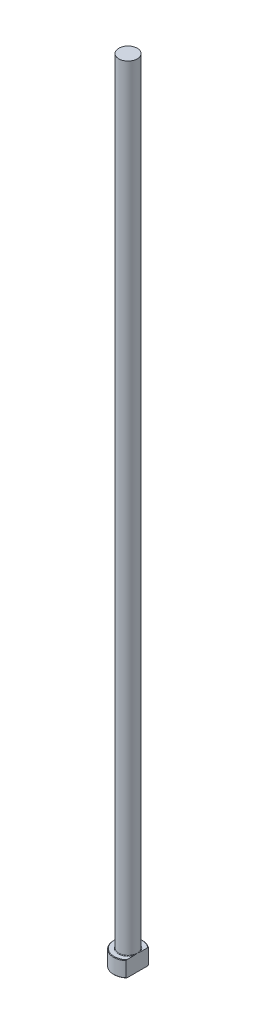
ISO-10303-21;
HEADER;
FILE_DESCRIPTION(('STEP AP214'),'2;1');
FILE_NAME('part.step','',(''),(''),'','','');
FILE_SCHEMA(('AUTOMOTIVE_DESIGN { 1 0 10303 214 1 1 1 1 }'));
ENDSEC;
DATA;
#1=APPLICATION_CONTEXT('core data for automotive mechanical design processes');
#2=APPLICATION_PROTOCOL_DEFINITION('international standard','automotive_design',2000,#1);
#3=PRODUCT_CONTEXT('',#1,'mechanical');
#4=PRODUCT('Part','Part','',(#3));
#5=PRODUCT_RELATED_PRODUCT_CATEGORY('part','',(#4));
#6=PRODUCT_DEFINITION_FORMATION('','',#4);
#7=PRODUCT_DEFINITION_CONTEXT('part definition',#1,'design');
#8=PRODUCT_DEFINITION('design','',#6,#7);
#9=PRODUCT_DEFINITION_SHAPE('','',#8);
#10=(LENGTH_UNIT() NAMED_UNIT(*) SI_UNIT(.MILLI.,.METRE.));
#11=(NAMED_UNIT(*) PLANE_ANGLE_UNIT() SI_UNIT($,.RADIAN.));
#12=(NAMED_UNIT(*) SI_UNIT($,.STERADIAN.) SOLID_ANGLE_UNIT());
#13=UNCERTAINTY_MEASURE_WITH_UNIT(LENGTH_MEASURE(1.E-05),#10,'distance_accuracy_value','');
#14=(GEOMETRIC_REPRESENTATION_CONTEXT(3) GLOBAL_UNCERTAINTY_ASSIGNED_CONTEXT((#13)) GLOBAL_UNIT_ASSIGNED_CONTEXT((#10,
#11,#12)) REPRESENTATION_CONTEXT('',''));
#15=CARTESIAN_POINT('',(0.,0.,0.));
#16=DIRECTION('',(0.,0.,1.));
#17=DIRECTION('',(1.,0.,0.));
#18=AXIS2_PLACEMENT_3D('',#15,#16,#17);
#19=CARTESIAN_POINT('',(0.,0.,0.));
#20=DIRECTION('',(0.,-1.,0.));
#21=DIRECTION('',(0.,0.,-1.));
#22=AXIS2_PLACEMENT_3D('',#19,#20,#21);
#23=PLANE('',#22);
#24=CARTESIAN_POINT('',(0.,0.,0.));
#25=DIRECTION('',(0.,-1.,0.));
#26=DIRECTION('',(0.,0.,-1.));
#27=AXIS2_PLACEMENT_3D('',#24,#25,#26);
#28=CIRCLE('',#27,5.30000000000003);
#29=CARTESIAN_POINT('',(3.49999999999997,0.,3.97994974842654));
#30=VERTEX_POINT('',#29);
#31=CARTESIAN_POINT('',(3.49999999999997,0.,-3.97994974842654));
#32=VERTEX_POINT('',#31);
#33=EDGE_CURVE('E98',#30,#32,#28,.T.);
#34=ORIENTED_EDGE('',*,*,#33,.T.);
#35=DIRECTION('',(0.,0.,1.));
#36=VECTOR('',#35,1.);
#37=CARTESIAN_POINT('',(3.49999999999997,0.,4.24264068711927));
#38=LINE('',#37,#36);
#39=EDGE_CURVE('E83',#32,#30,#38,.T.);
#40=ORIENTED_EDGE('',*,*,#39,.T.);
#41=EDGE_LOOP('',(#34,#40));
#42=FACE_BOUND('',#41,.T.);
#43=ADVANCED_FACE('F32',(#42),#23,.T.);
#44=CARTESIAN_POINT('',(0.,259.958771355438,0.));
#45=DIRECTION('',(0.,1.,0.));
#46=DIRECTION('',(0.,0.,1.));
#47=AXIS2_PLACEMENT_3D('',#44,#45,#46);
#48=CYLINDRICAL_SURFACE('',#47,5.49999999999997);
#49=CARTESIAN_POINT('',(0.,5.80000000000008,0.));
#50=DIRECTION('',(0.,1.,0.));
#51=DIRECTION('',(0.,0.,1.));
#52=AXIS2_PLACEMENT_3D('',#49,#50,#51);
#53=CIRCLE('',#52,5.49999999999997);
#54=CARTESIAN_POINT('',(3.49999999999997,5.80000000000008,4.24264068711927));
#55=VERTEX_POINT('',#54);
#56=CARTESIAN_POINT('',(3.49999999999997,5.80000000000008,-4.24264068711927));
#57=VERTEX_POINT('',#56);
#58=EDGE_CURVE('E104',#55,#57,#53,.F.);
#59=ORIENTED_EDGE('',*,*,#58,.T.);
#60=DIRECTION('',(0.,-1.,0.));
#61=VECTOR('',#60,1.);
#62=CARTESIAN_POINT('',(3.49999999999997,300.,-4.24264068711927));
#63=LINE('',#62,#61);
#64=CARTESIAN_POINT('',(3.49999999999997,0.199999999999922,-4.24264068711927));
#65=VERTEX_POINT('',#64);
#66=EDGE_CURVE('E183',#57,#65,#63,.T.);
#67=ORIENTED_EDGE('',*,*,#66,.T.);
#68=CARTESIAN_POINT('',(0.,0.199999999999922,0.));
#69=DIRECTION('',(0.,-1.,0.));
#70=DIRECTION('',(0.,0.,-1.));
#71=AXIS2_PLACEMENT_3D('',#68,#69,#70);
#72=CIRCLE('',#71,5.49999999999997);
#73=CARTESIAN_POINT('',(3.49999999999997,0.199999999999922,4.24264068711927));
#74=VERTEX_POINT('',#73);
#75=EDGE_CURVE('E100',#65,#74,#72,.F.);
#76=ORIENTED_EDGE('',*,*,#75,.T.);
#77=DIRECTION('',(0.,-1.,0.));
#78=VECTOR('',#77,1.);
#79=CARTESIAN_POINT('',(3.49999999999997,300.,4.24264068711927));
#80=LINE('',#79,#78);
#81=EDGE_CURVE('E93',#55,#74,#80,.T.);
#82=ORIENTED_EDGE('',*,*,#81,.F.);
#83=EDGE_LOOP('',(#59,#67,#76,#82));
#84=FACE_BOUND('',#83,.T.);
#85=ADVANCED_FACE('F158',(#84),#48,.T.);
#86=CARTESIAN_POINT('',(-5.49999999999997,6.,0.));
#87=DIRECTION('',(0.,1.,0.));
#88=DIRECTION('',(0.,0.,1.));
#89=AXIS2_PLACEMENT_3D('',#86,#87,#88);
#90=PLANE('',#89);
#91=CARTESIAN_POINT('',(0.,6.,0.));
#92=DIRECTION('',(0.,1.,0.));
#93=DIRECTION('',(0.,0.,1.));
#94=AXIS2_PLACEMENT_3D('',#91,#92,#93);
#95=CIRCLE('',#94,5.30000000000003);
#96=CARTESIAN_POINT('',(3.49999999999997,6.,-3.97994974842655));
#97=VERTEX_POINT('',#96);
#98=CARTESIAN_POINT('',(3.49999999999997,6.,3.97994974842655));
#99=VERTEX_POINT('',#98);
#100=EDGE_CURVE('E178',#97,#99,#95,.T.);
#101=ORIENTED_EDGE('',*,*,#100,.T.);
#102=DIRECTION('',(0.,0.,-1.));
#103=VECTOR('',#102,1.);
#104=CARTESIAN_POINT('',(3.49999999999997,6.,0.));
#105=LINE('',#104,#103);
#106=CARTESIAN_POINT('',(3.49999999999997,5.99999999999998,1.19999999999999));
#107=VERTEX_POINT('',#106);
#108=EDGE_CURVE('E57',#99,#107,#105,.T.);
#109=ORIENTED_EDGE('',*,*,#108,.T.);
#110=CARTESIAN_POINT('',(0.,6.,0.));
#111=DIRECTION('',(0.,1.,0.));
#112=DIRECTION('',(0.,0.,1.));
#113=AXIS2_PLACEMENT_3D('',#110,#111,#112);
#114=CIRCLE('',#113,3.69999999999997);
#115=CARTESIAN_POINT('',(3.49999999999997,5.99999999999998,-1.19999999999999));
#116=VERTEX_POINT('',#115);
#117=EDGE_CURVE('E107',#107,#116,#114,.F.);
#118=ORIENTED_EDGE('',*,*,#117,.T.);
#119=EDGE_CURVE('E136',#116,#97,#105,.T.);
#120=ORIENTED_EDGE('',*,*,#119,.T.);
#121=EDGE_LOOP('',(#101,#109,#118,#120));
#122=FACE_BOUND('',#121,.T.);
#123=ADVANCED_FACE('F147',(#122),#90,.T.);
#124=CARTESIAN_POINT('',(0.,6.00000000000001,0.));
#125=DIRECTION('',(0.,-1.,0.));
#126=DIRECTION('',(0.,0.,-1.));
#127=AXIS2_PLACEMENT_3D('',#124,#125,#126);
#128=CONICAL_SURFACE('',#127,5.30000000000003,0.785398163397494);
#129=ORIENTED_EDGE('',*,*,#58,.F.);
#130=CARTESIAN_POINT('',(3.49999999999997,1.33003849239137,9.33542352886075));
#131=CARTESIAN_POINT('',(3.49999999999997,1.46606755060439,9.19014587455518));
#132=CARTESIAN_POINT('',(3.49999999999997,1.60189091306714,9.04467563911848));
#133=CARTESIAN_POINT('',(3.49999999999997,1.8730593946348,8.75328845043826));
#134=CARTESIAN_POINT('',(3.49999999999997,2.00840451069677,8.60737149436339));
#135=CARTESIAN_POINT('',(3.49999999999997,2.41368868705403,8.16878624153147));
#136=CARTESIAN_POINT('',(3.49999999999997,2.68280695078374,7.87535778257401));
#137=CARTESIAN_POINT('',(3.49999999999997,3.22029202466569,7.28335275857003));
#138=CARTESIAN_POINT('',(3.49999999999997,3.48863408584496,6.9847536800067));
#139=CARTESIAN_POINT('',(3.49999999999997,4.02101445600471,6.38381794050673));
#140=CARTESIAN_POINT('',(3.49999999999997,4.28505346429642,6.08148190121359));
#141=CARTESIAN_POINT('',(3.49999999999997,4.76064644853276,5.52540485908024));
#142=CARTESIAN_POINT('',(3.49999999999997,4.97321621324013,5.27253724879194));
#143=CARTESIAN_POINT('',(3.49999999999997,5.28746532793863,4.88936279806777));
#144=CARTESIAN_POINT('',(3.49999999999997,5.39146981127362,4.76096380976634));
#145=CARTESIAN_POINT('',(3.49999999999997,5.59756866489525,4.50264388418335));
#146=CARTESIAN_POINT('',(3.49999999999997,5.69966308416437,4.3727229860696));
#147=CARTESIAN_POINT('',(3.49999999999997,5.90129005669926,4.11132273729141));
#148=CARTESIAN_POINT('',(3.49999999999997,6.0008273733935,3.97984706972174));
#149=CARTESIAN_POINT('',(3.49999999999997,6.19694716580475,3.71471559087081));
#150=CARTESIAN_POINT('',(3.49999999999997,6.29352983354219,3.58105992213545));
#151=CARTESIAN_POINT('',(3.49999999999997,6.48287386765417,3.31118530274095));
#152=CARTESIAN_POINT('',(3.49999999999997,6.57563763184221,3.17496804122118));
#153=CARTESIAN_POINT('',(3.49999999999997,6.75628267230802,2.89934683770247));
#154=CARTESIAN_POINT('',(3.49999999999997,6.84416488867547,2.75994351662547));
#155=CARTESIAN_POINT('',(3.49999999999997,6.99814457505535,2.50290457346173));
#156=CARTESIAN_POINT('',(3.49999999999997,7.06530217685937,2.38590684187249));
#157=CARTESIAN_POINT('',(3.49999999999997,7.19416460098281,2.14890235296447));
#158=CARTESIAN_POINT('',(3.49999999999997,7.25586874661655,2.0288952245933));
#159=CARTESIAN_POINT('',(3.49999999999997,7.37226286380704,1.78564087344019));
#160=CARTESIAN_POINT('',(3.49999999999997,7.42695969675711,1.6623969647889));
#161=CARTESIAN_POINT('',(3.49999999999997,7.5275197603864,1.4123362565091));
#162=CARTESIAN_POINT('',(3.49999999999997,7.57338548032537,1.28552047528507));
#163=CARTESIAN_POINT('',(3.49999999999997,7.64556102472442,1.05555158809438));
#164=CARTESIAN_POINT('',(3.49999999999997,7.67395518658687,0.953056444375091));
#165=CARTESIAN_POINT('',(3.49999999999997,7.72275092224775,0.746191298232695));
#166=CARTESIAN_POINT('',(3.49999999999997,7.74315535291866,0.641821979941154));
#167=CARTESIAN_POINT('',(3.49999999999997,7.77495944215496,0.432002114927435));
#168=CARTESIAN_POINT('',(3.49999999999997,7.78638437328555,0.326555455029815));
#169=CARTESIAN_POINT('',(3.49999999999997,7.79969943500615,0.115055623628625));
#170=CARTESIAN_POINT('',(3.49999999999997,7.8015899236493,0.00900247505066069));
#171=CARTESIAN_POINT('',(3.49999999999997,7.79572329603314,-0.202966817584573));
#172=CARTESIAN_POINT('',(3.49999999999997,7.78795394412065,-0.308882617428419));
#173=CARTESIAN_POINT('',(3.49999999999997,7.76318672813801,-0.519620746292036));
#174=CARTESIAN_POINT('',(3.49999999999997,7.74618811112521,-0.624442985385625));
#175=CARTESIAN_POINT('',(3.49999999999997,7.70376319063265,-0.832676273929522));
#176=CARTESIAN_POINT('',(3.49999999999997,7.67831139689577,-0.936082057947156));
#177=CARTESIAN_POINT('',(3.49999999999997,7.62008719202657,-1.14078653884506));
#178=CARTESIAN_POINT('',(3.49999999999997,7.58731462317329,-1.24208519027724));
#179=CARTESIAN_POINT('',(3.49999999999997,7.50935793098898,-1.45980073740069));
#180=CARTESIAN_POINT('',(3.49999999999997,7.46300722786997,-1.5757969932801));
#181=CARTESIAN_POINT('',(3.49999999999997,7.36341881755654,-1.80480236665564));
#182=CARTESIAN_POINT('',(3.49999999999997,7.31017881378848,-1.91781047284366));
#183=CARTESIAN_POINT('',(3.49999999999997,7.19809800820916,-2.14125149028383));
#184=CARTESIAN_POINT('',(3.49999999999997,7.13924715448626,-2.25167932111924));
#185=CARTESIAN_POINT('',(3.49999999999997,7.01714037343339,-2.47003557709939));
#186=CARTESIAN_POINT('',(3.49999999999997,6.95388506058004,-2.57796434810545));
#187=CARTESIAN_POINT('',(3.49999999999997,6.82298676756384,-2.79303108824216));
#188=CARTESIAN_POINT('',(3.49999999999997,6.75529770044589,-2.90014087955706));
#189=CARTESIAN_POINT('',(3.49999999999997,6.6169695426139,-3.112433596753));
#190=CARTESIAN_POINT('',(3.49999999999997,6.54633037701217,-3.21761647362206));
#191=CARTESIAN_POINT('',(3.49999999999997,6.33097773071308,-3.53046033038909));
#192=CARTESIAN_POINT('',(3.49999999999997,6.18268185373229,-3.73565296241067));
#193=CARTESIAN_POINT('',(3.49999999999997,5.84686519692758,-4.18490965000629));
#194=CARTESIAN_POINT('',(3.49999999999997,5.65778936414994,-4.42779920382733));
#195=CARTESIAN_POINT('',(3.49999999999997,5.27320376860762,-4.90845921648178));
#196=CARTESIAN_POINT('',(3.49999999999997,5.07769298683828,-5.14622885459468));
#197=CARTESIAN_POINT('',(3.49999999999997,4.68199594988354,-5.61823063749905));
#198=CARTESIAN_POINT('',(3.49999999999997,4.48180526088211,-5.85245905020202));
#199=CARTESIAN_POINT('',(3.49999999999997,4.07816705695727,-6.31809464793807));
#200=CARTESIAN_POINT('',(3.49999999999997,3.8747194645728,-6.54950176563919));
#201=CARTESIAN_POINT('',(3.49999999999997,3.47805105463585,-6.99590528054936));
#202=CARTESIAN_POINT('',(3.49999999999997,3.28497598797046,-7.21103144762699));
#203=CARTESIAN_POINT('',(3.49999999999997,2.89715235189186,-7.63977694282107));
#204=CARTESIAN_POINT('',(3.49999999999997,2.70240374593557,-7.85339623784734));
#205=CARTESIAN_POINT('',(3.49999999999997,2.31198639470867,-8.27898344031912));
#206=CARTESIAN_POINT('',(3.49999999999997,2.11632036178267,-8.49095383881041));
#207=CARTESIAN_POINT('',(3.49999999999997,1.72392141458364,-8.91388826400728));
#208=CARTESIAN_POINT('',(3.49999999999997,1.52718854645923,-9.1248523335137));
#209=CARTESIAN_POINT('',(3.49999999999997,1.33003849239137,-9.33542352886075));
#210=B_SPLINE_CURVE_WITH_KNOTS('',3,(#130,#131,#132,#133,#134,#135,#136,#137,#138,#139,#140,
#141,#142,#143,#144,#145,#146,#147,#148,#149,#150,#151,#152,#153,#154,#155,#156,#157,#158,#159,
#160,#161,#162,#163,#164,#165,#166,#167,#168,#169,#170,#171,#172,#173,#174,#175,#176,#177,#178,
#179,#180,#181,#182,#183,#184,#185,#186,#187,#188,#189,#190,#191,#192,#193,#194,#195,#196,#197,
#198,#199,#200,#201,#202,#203,#204,#205,#206,#207,#208,#209),.UNSPECIFIED.,.F.,.F.,(4,2,2,2,2,2,
2,2,2,2,2,2,2,2,2,2,2,2,2,2,2,2,2,2,2,2,2,2,2,2,2,2,2,2,2,2,2,2,2,4),(0.,0.597063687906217,
1.19413116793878,2.38857142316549,3.59291920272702,4.79706926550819,5.78802649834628,
6.28372320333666,6.77940717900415,7.27408870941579,7.76873802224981,8.26307186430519,
8.75731017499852,9.16190479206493,9.56654954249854,9.97079499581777,10.3749263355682,
10.6937207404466,11.0124010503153,11.3301811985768,11.6479494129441,11.9661205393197,
12.2843176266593,12.6034830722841,12.9226553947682,13.2971137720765,13.6716972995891,
14.0469649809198,14.4221804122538,14.8022378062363,15.1823048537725,15.9416042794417,
16.8648705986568,17.7882838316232,18.7126105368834,19.6369592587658,20.5041367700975,
21.37133326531,22.2367481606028,23.1021259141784),.UNSPECIFIED.);
#211=EDGE_CURVE('E135',#55,#99,#210,.T.);
#212=ORIENTED_EDGE('',*,*,#211,.T.);
#213=ORIENTED_EDGE('',*,*,#100,.F.);
#214=EDGE_CURVE('E127',#97,#57,#210,.T.);
#215=ORIENTED_EDGE('',*,*,#214,.T.);
#216=EDGE_LOOP('',(#129,#212,#213,#215));
#217=FACE_BOUND('',#216,.T.);
#218=ADVANCED_FACE('F143',(#217),#128,.T.);
#219=CARTESIAN_POINT('',(0.,0.199999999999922,0.));
#220=DIRECTION('',(0.,1.,0.));
#221=DIRECTION('',(0.,0.,1.));
#222=AXIS2_PLACEMENT_3D('',#219,#220,#221);
#223=CONICAL_SURFACE('',#222,5.49999999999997,0.785398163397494);
#224=ORIENTED_EDGE('',*,*,#75,.F.);
#225=CARTESIAN_POINT('',(3.49999999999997,4.66996150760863,-9.33542352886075));
#226=CARTESIAN_POINT('',(3.49999999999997,4.53393244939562,-9.19014587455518));
#227=CARTESIAN_POINT('',(3.49999999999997,4.39810908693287,-9.04467563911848));
#228=CARTESIAN_POINT('',(3.49999999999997,4.12694060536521,-8.75328845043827));
#229=CARTESIAN_POINT('',(3.49999999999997,3.99159548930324,-8.60737149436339));
#230=CARTESIAN_POINT('',(3.49999999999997,3.58631131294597,-8.16878624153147));
#231=CARTESIAN_POINT('',(3.49999999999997,3.31719304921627,-7.87535778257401));
#232=CARTESIAN_POINT('',(3.49999999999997,2.77970797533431,-7.28335275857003));
#233=CARTESIAN_POINT('',(3.49999999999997,2.51136591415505,-6.9847536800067));
#234=CARTESIAN_POINT('',(3.49999999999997,1.97898554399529,-6.38381794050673));
#235=CARTESIAN_POINT('',(3.49999999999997,1.71494653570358,-6.08148190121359));
#236=CARTESIAN_POINT('',(3.49999999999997,1.23935355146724,-5.52540485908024));
#237=CARTESIAN_POINT('',(3.49999999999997,1.02678378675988,-5.27253724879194));
#238=CARTESIAN_POINT('',(3.49999999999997,0.712534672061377,-4.88936279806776));
#239=CARTESIAN_POINT('',(3.49999999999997,0.608530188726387,-4.76096380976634));
#240=CARTESIAN_POINT('',(3.49999999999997,0.402431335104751,-4.50264388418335));
#241=CARTESIAN_POINT('',(3.49999999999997,0.300336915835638,-4.3727229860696));
#242=CARTESIAN_POINT('',(3.49999999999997,0.0987099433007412,-4.11132273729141));
#243=CARTESIAN_POINT('',(3.49999999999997,-0.000827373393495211,-3.97984706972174));
#244=CARTESIAN_POINT('',(3.49999999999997,-0.196947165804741,-3.71471559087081));
#245=CARTESIAN_POINT('',(3.49999999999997,-0.293529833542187,-3.58105992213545));
#246=CARTESIAN_POINT('',(3.49999999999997,-0.482873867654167,-3.31118530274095));
#247=CARTESIAN_POINT('',(3.49999999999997,-0.575637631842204,-3.17496804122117));
#248=CARTESIAN_POINT('',(3.49999999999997,-0.756282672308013,-2.89934683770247));
#249=CARTESIAN_POINT('',(3.49999999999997,-0.844164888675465,-2.75994351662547));
#250=CARTESIAN_POINT('',(3.49999999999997,-0.998144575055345,-2.50290457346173));
#251=CARTESIAN_POINT('',(3.49999999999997,-1.06530217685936,-2.38590684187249));
#252=CARTESIAN_POINT('',(3.49999999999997,-1.1941646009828,-2.14890235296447));
#253=CARTESIAN_POINT('',(3.49999999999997,-1.25586874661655,-2.0288952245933));
#254=CARTESIAN_POINT('',(3.49999999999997,-1.37226286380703,-1.78564087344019));
#255=CARTESIAN_POINT('',(3.49999999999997,-1.42695969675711,-1.6623969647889));
#256=CARTESIAN_POINT('',(3.49999999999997,-1.52751976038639,-1.4123362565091));
#257=CARTESIAN_POINT('',(3.49999999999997,-1.57338548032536,-1.28552047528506));
#258=CARTESIAN_POINT('',(3.49999999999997,-1.64556102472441,-1.05555158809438));
#259=CARTESIAN_POINT('',(3.49999999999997,-1.67395518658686,-0.95305644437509));
#260=CARTESIAN_POINT('',(3.49999999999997,-1.72275092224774,-0.746191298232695));
#261=CARTESIAN_POINT('',(3.49999999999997,-1.74315535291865,-0.641821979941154));
#262=CARTESIAN_POINT('',(3.49999999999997,-1.77495944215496,-0.432002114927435));
#263=CARTESIAN_POINT('',(3.49999999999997,-1.78638437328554,-0.326555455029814));
#264=CARTESIAN_POINT('',(3.49999999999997,-1.79969943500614,-0.115055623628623));
#265=CARTESIAN_POINT('',(3.49999999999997,-1.8015899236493,-0.00900247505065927));
#266=CARTESIAN_POINT('',(3.49999999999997,-1.79572329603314,0.202966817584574));
#267=CARTESIAN_POINT('',(3.49999999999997,-1.78795394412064,0.30888261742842));
#268=CARTESIAN_POINT('',(3.49999999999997,-1.76318672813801,0.519620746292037));
#269=CARTESIAN_POINT('',(3.49999999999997,-1.74618811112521,0.624442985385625));
#270=CARTESIAN_POINT('',(3.49999999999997,-1.70376319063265,0.832676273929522));
#271=CARTESIAN_POINT('',(3.49999999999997,-1.67831139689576,0.936082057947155));
#272=CARTESIAN_POINT('',(3.49999999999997,-1.62008719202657,1.14078653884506));
#273=CARTESIAN_POINT('',(3.49999999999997,-1.58731462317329,1.24208519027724));
#274=CARTESIAN_POINT('',(3.49999999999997,-1.50935793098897,1.45980073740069));
#275=CARTESIAN_POINT('',(3.49999999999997,-1.46300722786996,1.5757969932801));
#276=CARTESIAN_POINT('',(3.49999999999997,-1.36341881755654,1.80480236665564));
#277=CARTESIAN_POINT('',(3.49999999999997,-1.31017881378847,1.91781047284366));
#278=CARTESIAN_POINT('',(3.49999999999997,-1.19809800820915,2.14125149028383));
#279=CARTESIAN_POINT('',(3.49999999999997,-1.13924715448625,2.25167932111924));
#280=CARTESIAN_POINT('',(3.49999999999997,-1.01714037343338,2.47003557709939));
#281=CARTESIAN_POINT('',(3.49999999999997,-0.953885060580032,2.57796434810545));
#282=CARTESIAN_POINT('',(3.49999999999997,-0.822986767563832,2.79303108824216));
#283=CARTESIAN_POINT('',(3.49999999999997,-0.755297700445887,2.90014087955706));
#284=CARTESIAN_POINT('',(3.49999999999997,-0.616969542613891,3.112433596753));
#285=CARTESIAN_POINT('',(3.49999999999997,-0.546330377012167,3.21761647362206));
#286=CARTESIAN_POINT('',(3.49999999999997,-0.330977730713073,3.53046033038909));
#287=CARTESIAN_POINT('',(3.49999999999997,-0.182681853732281,3.73565296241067));
#288=CARTESIAN_POINT('',(3.49999999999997,0.153134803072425,4.18490965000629));
#289=CARTESIAN_POINT('',(3.49999999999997,0.342210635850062,4.42779920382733));
#290=CARTESIAN_POINT('',(3.49999999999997,0.726796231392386,4.90845921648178));
#291=CARTESIAN_POINT('',(3.49999999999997,0.922307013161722,5.14622885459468));
#292=CARTESIAN_POINT('',(3.49999999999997,1.31800405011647,5.61823063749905));
#293=CARTESIAN_POINT('',(3.49999999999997,1.5181947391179,5.85245905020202));
#294=CARTESIAN_POINT('',(3.49999999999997,1.92183294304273,6.31809464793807));
#295=CARTESIAN_POINT('',(3.49999999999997,2.1252805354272,6.54950176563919));
#296=CARTESIAN_POINT('',(3.49999999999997,2.52194894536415,6.99590528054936));
#297=CARTESIAN_POINT('',(3.49999999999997,2.71502401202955,7.21103144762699));
#298=CARTESIAN_POINT('',(3.49999999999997,3.10284764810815,7.63977694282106));
#299=CARTESIAN_POINT('',(3.49999999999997,3.29759625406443,7.85339623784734));
#300=CARTESIAN_POINT('',(3.49999999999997,3.68801360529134,8.27898344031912));
#301=CARTESIAN_POINT('',(3.49999999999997,3.88367963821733,8.49095383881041));
#302=CARTESIAN_POINT('',(3.49999999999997,4.27607858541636,8.91388826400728));
#303=CARTESIAN_POINT('',(3.49999999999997,4.47281145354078,9.1248523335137));
#304=CARTESIAN_POINT('',(3.49999999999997,4.66996150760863,9.33542352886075));
#305=B_SPLINE_CURVE_WITH_KNOTS('',3,(#225,#226,#227,#228,#229,#230,#231,#232,#233,#234,#235,
#236,#237,#238,#239,#240,#241,#242,#243,#244,#245,#246,#247,#248,#249,#250,#251,#252,#253,#254,
#255,#256,#257,#258,#259,#260,#261,#262,#263,#264,#265,#266,#267,#268,#269,#270,#271,#272,#273,
#274,#275,#276,#277,#278,#279,#280,#281,#282,#283,#284,#285,#286,#287,#288,#289,#290,#291,#292,
#293,#294,#295,#296,#297,#298,#299,#300,#301,#302,#303,#304),.UNSPECIFIED.,.F.,.F.,(4,2,2,2,2,2,
2,2,2,2,2,2,2,2,2,2,2,2,2,2,2,2,2,2,2,2,2,2,2,2,2,2,2,2,2,2,2,2,2,4),(0.,0.597063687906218,
1.19413116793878,2.38857142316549,3.59291920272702,4.79706926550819,5.78802649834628,
6.28372320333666,6.77940717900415,7.27408870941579,7.76873802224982,8.26307186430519,
8.75731017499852,9.16190479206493,9.56654954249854,9.97079499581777,10.3749263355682,
10.6937207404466,11.0124010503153,11.3301811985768,11.6479494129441,11.9661205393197,
12.2843176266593,12.6034830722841,12.9226553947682,13.2971137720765,13.6716972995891,
14.0469649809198,14.4221804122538,14.8022378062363,15.1823048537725,15.9416042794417,
16.8648705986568,17.7882838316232,18.7126105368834,19.6369592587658,20.5041367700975,
21.37133326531,22.2367481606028,23.1021259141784),.UNSPECIFIED.);
#306=EDGE_CURVE('E86',#65,#32,#305,.T.);
#307=ORIENTED_EDGE('',*,*,#306,.T.);
#308=ORIENTED_EDGE('',*,*,#33,.F.);
#309=EDGE_CURVE('E89',#30,#74,#305,.T.);
#310=ORIENTED_EDGE('',*,*,#309,.T.);
#311=EDGE_LOOP('',(#224,#307,#308,#310));
#312=FACE_BOUND('',#311,.T.);
#313=ADVANCED_FACE('F97',(#312),#223,.T.);
#314=CARTESIAN_POINT('',(0.,6.19999999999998,0.));
#315=DIRECTION('',(0.,1.,0.));
#316=DIRECTION('',(0.,0.,1.));
#317=AXIS2_PLACEMENT_3D('',#314,#315,#316);
#318=TOROIDAL_SURFACE('',#317,3.69999999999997,0.2);
#319=CARTESIAN_POINT('',(3.49999999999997,6.19999999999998,0.));
#320=CARTESIAN_POINT('',(3.49999999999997,6.20000050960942,9.9809354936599E-11));
#321=CARTESIAN_POINT('',(3.49999999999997,6.20000101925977,-2.1348674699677E-07));
#322=CARTESIAN_POINT('',(3.49999999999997,6.20000196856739,-7.95759129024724E-07));
#323=CARTESIAN_POINT('',(3.49999999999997,6.20000239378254,-1.17925839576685E-06));
#324=CARTESIAN_POINT('',(3.49999999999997,6.20000328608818,-2.10014972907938E-06));
#325=CARTESIAN_POINT('',(3.49999999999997,6.20000373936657,-2.65249908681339E-06));
#326=CARTESIAN_POINT('',(3.49999999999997,6.20000454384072,-3.7911288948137E-06));
#327=CARTESIAN_POINT('',(3.49999999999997,6.20000489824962,-4.37533521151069E-06));
#328=CARTESIAN_POINT('',(3.49999999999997,6.20000623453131,-6.66270059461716E-06));
#329=CARTESIAN_POINT('',(3.49999999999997,6.20000714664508,-8.40961025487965E-06));
#330=CARTESIAN_POINT('',(3.49999999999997,6.20000862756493,-1.18496824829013E-05));
#331=CARTESIAN_POINT('',(3.49999999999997,6.20000922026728,-1.3532954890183E-05));
#332=CARTESIAN_POINT('',(3.49999999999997,6.20001174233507,-2.07268950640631E-05));
#333=CARTESIAN_POINT('',(3.49999999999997,6.20001365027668,-2.62477536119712E-05));
#334=CARTESIAN_POINT('',(3.49999999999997,6.20001642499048,-3.66274572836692E-05));
#335=CARTESIAN_POINT('',(3.49999999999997,6.20001740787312,-4.14549355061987E-05));
#336=CARTESIAN_POINT('',(3.49999999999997,6.20002462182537,-7.75352102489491E-05));
#337=CARTESIAN_POINT('',(3.49999999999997,6.20003014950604,-0.000108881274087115));
#338=CARTESIAN_POINT('',(3.49999999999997,6.20005434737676,-0.000233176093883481));
#339=CARTESIAN_POINT('',(3.49999999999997,6.20007737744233,-0.000325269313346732));
#340=CARTESIAN_POINT('',(3.49999999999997,6.20016742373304,-0.000691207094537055));
#341=CARTESIAN_POINT('',(3.49999999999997,6.20023166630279,-0.000965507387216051));
#342=CARTESIAN_POINT('',(3.49999999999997,6.20048971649,-0.00205944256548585));
#343=CARTESIAN_POINT('',(3.49999999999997,6.20068705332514,-0.00287847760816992));
#344=CARTESIAN_POINT('',(3.49999999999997,6.20150941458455,-0.00630050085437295));
#345=CARTESIAN_POINT('',(3.49999999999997,6.20212997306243,-0.00890424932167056));
#346=CARTESIAN_POINT('',(3.49999999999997,6.2070391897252,-0.0294912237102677));
#347=CARTESIAN_POINT('',(3.49999999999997,6.2113430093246,-0.047471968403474));
#348=CARTESIAN_POINT('',(3.49999999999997,6.21975360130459,-0.082719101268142));
#349=CARTESIAN_POINT('',(3.49999999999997,6.22386136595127,-0.0999852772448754));
#350=CARTESIAN_POINT('',(3.49999999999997,6.2372401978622,-0.156405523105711));
#351=CARTESIAN_POINT('',(3.49999999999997,6.24645854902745,-0.195572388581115));
#352=CARTESIAN_POINT('',(3.49999999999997,6.26203234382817,-0.262828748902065));
#353=CARTESIAN_POINT('',(3.49999999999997,6.26845671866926,-0.290902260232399));
#354=CARTESIAN_POINT('',(3.49999999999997,6.28094671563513,-0.346379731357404));
#355=CARTESIAN_POINT('',(3.49999999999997,6.28701730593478,-0.373782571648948));
#356=CARTESIAN_POINT('',(3.49999999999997,6.30077691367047,-0.437211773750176));
#357=CARTESIAN_POINT('',(3.49999999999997,6.3083789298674,-0.473257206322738));
#358=CARTESIAN_POINT('',(3.49999999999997,6.32309409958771,-0.545736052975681));
#359=CARTESIAN_POINT('',(3.49999999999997,6.33020304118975,-0.582170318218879));
#360=CARTESIAN_POINT('',(3.49999999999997,6.35161649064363,-0.697757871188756));
#361=CARTESIAN_POINT('',(3.49999999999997,6.36463967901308,-0.777158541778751));
#362=CARTESIAN_POINT('',(3.49999999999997,6.3843837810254,-0.92756184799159));
#363=CARTESIAN_POINT('',(3.49999999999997,6.39165512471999,-0.998486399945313));
#364=CARTESIAN_POINT('',(3.49999999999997,6.3979989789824,-1.10437287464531));
#365=CARTESIAN_POINT('',(3.49999999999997,6.39936233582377,-1.13919451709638));
#366=CARTESIAN_POINT('',(3.49999999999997,6.40028946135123,-1.20885098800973));
#367=CARTESIAN_POINT('',(3.49999999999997,6.39985418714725,-1.24368579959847));
#368=CARTESIAN_POINT('',(3.49999999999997,6.39686573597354,-1.30963279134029));
#369=CARTESIAN_POINT('',(3.49999999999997,6.39453835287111,-1.34075403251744));
#370=CARTESIAN_POINT('',(3.49999999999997,6.38750048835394,-1.40298456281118));
#371=CARTESIAN_POINT('',(3.49999999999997,6.38277118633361,-1.43409178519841));
#372=CARTESIAN_POINT('',(3.49999999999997,6.37000596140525,-1.49609278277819));
#373=CARTESIAN_POINT('',(3.49999999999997,6.36193044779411,-1.52697933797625));
#374=CARTESIAN_POINT('',(3.49999999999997,6.34614337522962,-1.57192957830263));
#375=CARTESIAN_POINT('',(3.49999999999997,6.3402919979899,-1.5866404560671));
#376=CARTESIAN_POINT('',(3.49999999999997,6.32701491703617,-1.6153215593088));
#377=CARTESIAN_POINT('',(3.49999999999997,6.31959341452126,-1.6292936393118));
#378=CARTESIAN_POINT('',(3.49999999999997,6.30547056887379,-1.65150372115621));
#379=CARTESIAN_POINT('',(3.49999999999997,6.29934759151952,-1.6601058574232));
#380=CARTESIAN_POINT('',(3.49999999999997,6.28595656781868,-1.67637400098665));
#381=CARTESIAN_POINT('',(3.49999999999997,6.27869146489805,-1.68404232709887));
#382=CARTESIAN_POINT('',(3.49999999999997,6.26587375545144,-1.69518467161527));
#383=CARTESIAN_POINT('',(3.49999999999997,6.26073958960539,-1.69913647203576));
#384=CARTESIAN_POINT('',(3.49999999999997,6.24994100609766,-1.70624293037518));
#385=CARTESIAN_POINT('',(3.49999999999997,6.24427723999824,-1.70939855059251));
#386=CARTESIAN_POINT('',(3.49999999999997,6.23351378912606,-1.71418736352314));
#387=CARTESIAN_POINT('',(3.49999999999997,6.22849079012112,-1.71599090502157));
#388=CARTESIAN_POINT('',(3.49999999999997,6.21821361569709,-1.71873268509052));
#389=CARTESIAN_POINT('',(3.49999999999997,6.21295968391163,-1.71967181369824));
#390=CARTESIAN_POINT('',(3.49999999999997,6.20234462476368,-1.72059432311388));
#391=CARTESIAN_POINT('',(3.49999999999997,6.19698314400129,-1.72057373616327));
#392=CARTESIAN_POINT('',(3.49999999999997,6.18635093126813,-1.71956893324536));
#393=CARTESIAN_POINT('',(3.49999999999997,6.18108024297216,-1.71858426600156));
#394=CARTESIAN_POINT('',(3.49999999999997,6.17106869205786,-1.71582968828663));
#395=CARTESIAN_POINT('',(3.49999999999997,6.16631466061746,-1.71410641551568));
#396=CARTESIAN_POINT('',(3.49999999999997,6.15709718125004,-1.71001459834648));
#397=CARTESIAN_POINT('',(3.49999999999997,6.15263381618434,-1.70764587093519));
#398=CARTESIAN_POINT('',(3.49999999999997,6.14110717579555,-1.70060771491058));
#399=CARTESIAN_POINT('',(3.49999999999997,6.13433222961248,-1.69546710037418));
#400=CARTESIAN_POINT('',(3.49999999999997,6.12164557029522,-1.68420869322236));
#401=CARTESIAN_POINT('',(3.49999999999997,6.11573697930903,-1.67808752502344));
#402=CARTESIAN_POINT('',(3.49999999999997,6.10028952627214,-1.66008531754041));
#403=CARTESIAN_POINT('',(3.49999999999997,6.09159238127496,-1.64748936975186));
#404=CARTESIAN_POINT('',(3.49999999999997,6.07604019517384,-1.62125022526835));
#405=CARTESIAN_POINT('',(3.49999999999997,6.06918749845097,-1.60760572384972));
#406=CARTESIAN_POINT('',(3.49999999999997,6.05635908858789,-1.57851190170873));
#407=CARTESIAN_POINT('',(3.49999999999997,6.05050870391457,-1.56300807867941));
#408=CARTESIAN_POINT('',(3.49999999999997,6.04009412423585,-1.53156759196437));
#409=CARTESIAN_POINT('',(3.49999999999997,6.03553147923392,-1.51563043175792));
#410=CARTESIAN_POINT('',(3.49999999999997,6.02331191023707,-1.46712048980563));
#411=CARTESIAN_POINT('',(3.49999999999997,6.01724153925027,-1.4341495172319));
#412=CARTESIAN_POINT('',(3.49999999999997,6.00883071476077,-1.37348993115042));
#413=CARTESIAN_POINT('',(3.49999999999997,6.00603148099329,-1.34585663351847));
#414=CARTESIAN_POINT('',(3.49999999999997,6.00204762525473,-1.29046925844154));
#415=CARTESIAN_POINT('',(3.49999999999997,6.00086336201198,-1.26271515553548));
#416=CARTESIAN_POINT('',(3.49999999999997,5.99925913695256,-1.17922229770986));
#417=CARTESIAN_POINT('',(3.49999999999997,6.00080993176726,-1.1234488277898));
#418=CARTESIAN_POINT('',(3.49999999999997,6.00738569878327,-1.01528124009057));
#419=CARTESIAN_POINT('',(3.49999999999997,6.01221131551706,-0.962872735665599));
#420=CARTESIAN_POINT('',(3.49999999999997,6.02425367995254,-0.858750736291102));
#421=CARTESIAN_POINT('',(3.49999999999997,6.03145152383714,-0.807035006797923));
#422=CARTESIAN_POINT('',(3.49999999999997,6.04786442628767,-0.702500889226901));
#423=CARTESIAN_POINT('',(3.49999999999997,6.05712869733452,-0.649690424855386));
#424=CARTESIAN_POINT('',(3.49999999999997,6.07730630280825,-0.542969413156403));
#425=CARTESIAN_POINT('',(3.49999999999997,6.08825618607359,-0.489065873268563));
#426=CARTESIAN_POINT('',(3.49999999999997,6.10770336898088,-0.397738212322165));
#427=CARTESIAN_POINT('',(3.49999999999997,6.11594150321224,-0.360258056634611));
#428=CARTESIAN_POINT('',(3.49999999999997,6.1326812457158,-0.285797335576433));
#429=CARTESIAN_POINT('',(3.49999999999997,6.14117887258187,-0.248815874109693));
#430=CARTESIAN_POINT('',(3.49999999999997,6.15740628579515,-0.179140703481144));
#431=CARTESIAN_POINT('',(3.49999999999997,6.1651124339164,-0.146441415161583));
#432=CARTESIAN_POINT('',(3.49999999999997,6.18096853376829,-0.0796648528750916));
#433=CARTESIAN_POINT('',(3.49999999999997,6.18912333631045,-0.0455886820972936));
#434=CARTESIAN_POINT('',(3.49999999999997,6.19787118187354,-0.00889903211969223));
#435=CARTESIAN_POINT('',(3.49999999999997,6.19849305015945,-0.00629009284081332));
#436=CARTESIAN_POINT('',(3.49999999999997,6.19931571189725,-0.00286690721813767));
#437=CARTESIAN_POINT('',(3.49999999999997,6.19951207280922,-0.00205190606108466));
#438=CARTESIAN_POINT('',(3.49999999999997,6.19976893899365,-0.000962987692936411));
#439=CARTESIAN_POINT('',(3.49999999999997,6.19983295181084,-0.000689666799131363));
#440=CARTESIAN_POINT('',(3.49999999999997,6.19992272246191,-0.000324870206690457));
#441=CARTESIAN_POINT('',(3.49999999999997,6.19994571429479,-0.000232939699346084));
#442=CARTESIAN_POINT('',(3.49999999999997,6.19996987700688,-0.000108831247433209));
#443=CARTESIAN_POINT('',(3.49999999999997,6.19997540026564,-7.75074375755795E-05));
#444=CARTESIAN_POINT('',(3.49999999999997,6.19998260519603,-4.14499502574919E-05));
#445=CARTESIAN_POINT('',(3.49999999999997,6.19998358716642,-3.66236562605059E-05));
#446=CARTESIAN_POINT('',(3.49999999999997,6.19998635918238,-2.62464271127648E-05));
#447=CARTESIAN_POINT('',(3.49999999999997,6.19998826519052,-2.07267962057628E-05));
#448=CARTESIAN_POINT('',(3.49999999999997,6.19999078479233,-1.35341428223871E-05));
#449=CARTESIAN_POINT('',(3.49999999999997,6.19999137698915,-1.18509583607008E-05));
#450=CARTESIAN_POINT('',(3.49999999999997,6.19999285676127,-8.41098341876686E-06));
#451=CARTESIAN_POINT('',(3.49999999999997,6.19999376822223,-6.66407126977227E-06));
#452=CARTESIAN_POINT('',(3.49999999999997,6.19999510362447,-4.37661194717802E-06));
#453=CARTESIAN_POINT('',(3.49999999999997,6.19999545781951,-3.79235333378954E-06));
#454=CARTESIAN_POINT('',(3.49999999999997,6.19999626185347,-2.65358032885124E-06));
#455=CARTESIAN_POINT('',(3.49999999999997,6.19999671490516,-2.10113839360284E-06));
#456=CARTESIAN_POINT('',(3.49999999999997,6.1999976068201,-1.18003190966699E-06));
#457=CARTESIAN_POINT('',(3.49999999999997,6.19999803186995,-7.964187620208E-07));
#458=CARTESIAN_POINT('',(3.49999999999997,6.19999898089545,-2.13855187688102E-07));
#459=CARTESIAN_POINT('',(3.49999999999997,6.19999949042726,-9.98021657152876E-11));
#460=CARTESIAN_POINT('',(3.49999999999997,6.19999999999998,0.));
#461=B_SPLINE_CURVE_WITH_KNOTS('',3,(#319,#320,#321,#322,#323,#324,#325,#326,#327,#328,#329,
#330,#331,#332,#333,#334,#335,#336,#337,#338,#339,#340,#341,#342,#343,#344,#345,#346,#347,#348,
#349,#350,#351,#352,#353,#354,#355,#356,#357,#358,#359,#360,#361,#362,#363,#364,#365,#366,#367,
#368,#369,#370,#371,#372,#373,#374,#375,#376,#377,#378,#379,#380,#381,#382,#383,#384,#385,#386,
#387,#388,#389,#390,#391,#392,#393,#394,#395,#396,#397,#398,#399,#400,#401,#402,#403,#404,#405,
#406,#407,#408,#409,#410,#411,#412,#413,#414,#415,#416,#417,#418,#419,#420,#421,#422,#423,#424,
#425,#426,#427,#428,#429,#430,#431,#432,#433,#434,#435,#436,#437,#438,#439,#440,#441,#442,#443,
#444,#445,#446,#447,#448,#449,#450,#451,#452,#453,#454,#455,#456,#457,#458,#459,#460),
.UNSPECIFIED.,.T.,.F.,(4,2,2,2,2,2,2,2,2,2,2,2,2,2,2,2,2,2,2,2,2,2,2,2,2,2,2,2,2,2,2,2,2,2,2,2,
2,2,2,2,2,2,2,2,2,2,2,2,2,2,2,2,2,2,2,2,2,2,2,2,2,2,2,2,2,2,2,2,2,2,4),(0.,1.54778905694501E-06,
3.27068856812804E-06,5.40032147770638E-06,7.44938901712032E-06,1.33412905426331E-05,
1.86900588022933E-05,3.61865044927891E-05,5.09488028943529E-05,0.000146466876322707,
0.000431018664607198,0.001276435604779,0.00380354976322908,0.0118339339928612,
0.0672984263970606,0.120543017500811,0.24125328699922,0.327650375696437,0.411851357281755,
0.52236238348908,0.633723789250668,0.875007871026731,1.08869711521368,1.19320699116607,
1.29766126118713,1.39121331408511,1.4855099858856,1.58095571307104,1.62839133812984,
1.67570160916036,1.70731126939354,1.73884076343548,1.75822424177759,1.77758417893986,
1.79352969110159,1.80945876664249,1.82545370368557,1.84145613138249,1.8565700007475,
1.8716881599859,1.89705349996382,1.92250811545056,1.96816999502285,2.01388964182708,
2.06352392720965,2.11321770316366,2.21356505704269,2.29684564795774,2.3801447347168,
2.54733140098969,2.70515844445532,2.86175703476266,3.02258329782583,3.18758220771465,
3.30270498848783,3.41653913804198,3.51732480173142,3.62243689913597,3.63048332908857,
3.63299799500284,3.63384039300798,3.63412444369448,3.6342198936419,3.63423465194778,
3.63425214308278,3.63425749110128,3.63426338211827,3.63426543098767,3.63426756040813,
3.63426928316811,3.63427083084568),.UNSPECIFIED.);
#462=CARTESIAN_POINT('',(3.49999999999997,6.19999999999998,0.));
#463=VERTEX_POINT('',#462);
#464=EDGE_CURVE('E11',#116,#463,#461,.T.);
#465=ORIENTED_EDGE('',*,*,#464,.F.);
#466=ORIENTED_EDGE('',*,*,#117,.F.);
#467=CARTESIAN_POINT('',(3.49999999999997,6.19999999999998,0.));
#468=CARTESIAN_POINT('',(3.49999999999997,6.19999949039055,-9.98097226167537E-11));
#469=CARTESIAN_POINT('',(3.49999999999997,6.1999989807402,2.13486746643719E-07));
#470=CARTESIAN_POINT('',(3.49999999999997,6.19999803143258,7.95759128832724E-07));
#471=CARTESIAN_POINT('',(3.49999999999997,6.19999760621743,1.17925839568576E-06));
#472=CARTESIAN_POINT('',(3.49999999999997,6.19999671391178,2.10014972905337E-06));
#473=CARTESIAN_POINT('',(3.49999999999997,6.19999626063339,2.65249908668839E-06));
#474=CARTESIAN_POINT('',(3.49999999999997,6.19999545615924,3.79112889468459E-06));
#475=CARTESIAN_POINT('',(3.49999999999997,6.19999510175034,4.37533521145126E-06));
#476=CARTESIAN_POINT('',(3.49999999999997,6.19999376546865,6.66270059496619E-06));
#477=CARTESIAN_POINT('',(3.49999999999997,6.19999285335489,8.4096102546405E-06));
#478=CARTESIAN_POINT('',(3.49999999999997,6.19999137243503,1.1849682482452E-05));
#479=CARTESIAN_POINT('',(3.49999999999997,6.19999077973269,1.35329548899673E-05));
#480=CARTESIAN_POINT('',(3.49999999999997,6.1999882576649,2.07268950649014E-05));
#481=CARTESIAN_POINT('',(3.49999999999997,6.19998634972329,2.62477536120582E-05));
#482=CARTESIAN_POINT('',(3.49999999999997,6.19998357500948,3.66274572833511E-05));
#483=CARTESIAN_POINT('',(3.49999999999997,6.19998259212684,4.1454935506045E-05));
#484=CARTESIAN_POINT('',(3.49999999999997,6.1999753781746,7.75352102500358E-05));
#485=CARTESIAN_POINT('',(3.49999999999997,6.19996985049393,0.000108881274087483));
#486=CARTESIAN_POINT('',(3.49999999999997,6.1999456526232,0.000233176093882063));
#487=CARTESIAN_POINT('',(3.49999999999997,6.19992262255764,0.000325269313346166));
#488=CARTESIAN_POINT('',(3.49999999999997,6.19983257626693,0.000691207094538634));
#489=CARTESIAN_POINT('',(3.49999999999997,6.19976833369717,0.000965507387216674));
#490=CARTESIAN_POINT('',(3.49999999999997,6.19951028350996,0.00205944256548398));
#491=CARTESIAN_POINT('',(3.49999999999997,6.19931294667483,0.00287847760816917));
#492=CARTESIAN_POINT('',(3.49999999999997,6.19849058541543,0.00630050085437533));
#493=CARTESIAN_POINT('',(3.49999999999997,6.19787002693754,0.00890424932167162));
#494=CARTESIAN_POINT('',(3.49999999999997,6.19296081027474,0.0294912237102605));
#495=CARTESIAN_POINT('',(3.49999999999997,6.18865699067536,0.0474719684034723));
#496=CARTESIAN_POINT('',(3.49999999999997,6.18024639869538,0.0827191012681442));
#497=CARTESIAN_POINT('',(3.49999999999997,6.1761386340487,0.0999852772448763));
#498=CARTESIAN_POINT('',(3.49999999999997,6.16275980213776,0.156405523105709));
#499=CARTESIAN_POINT('',(3.49999999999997,6.15354145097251,0.195572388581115));
#500=CARTESIAN_POINT('',(3.49999999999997,6.1379676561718,0.262828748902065));
#501=CARTESIAN_POINT('',(3.49999999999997,6.13154328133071,0.290902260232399));
#502=CARTESIAN_POINT('',(3.49999999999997,6.11905328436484,0.346379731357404));
#503=CARTESIAN_POINT('',(3.49999999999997,6.11298269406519,0.373782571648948));
#504=CARTESIAN_POINT('',(3.49999999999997,6.09922308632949,0.437211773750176));
#505=CARTESIAN_POINT('',(3.49999999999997,6.09162107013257,0.473257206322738));
#506=CARTESIAN_POINT('',(3.49999999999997,6.07690590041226,0.545736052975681));
#507=CARTESIAN_POINT('',(3.49999999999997,6.06979695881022,0.582170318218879));
#508=CARTESIAN_POINT('',(3.49999999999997,6.04838350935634,0.697757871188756));
#509=CARTESIAN_POINT('',(3.49999999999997,6.03536032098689,0.777158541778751));
#510=CARTESIAN_POINT('',(3.49999999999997,6.01561621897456,0.92756184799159));
#511=CARTESIAN_POINT('',(3.49999999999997,6.00834487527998,0.998486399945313));
#512=CARTESIAN_POINT('',(3.49999999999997,6.00200102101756,1.10437287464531));
#513=CARTESIAN_POINT('',(3.49999999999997,6.00063766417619,1.13919451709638));
#514=CARTESIAN_POINT('',(3.49999999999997,5.99971053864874,1.20885098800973));
#515=CARTESIAN_POINT('',(3.49999999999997,6.00014581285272,1.24368579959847));
#516=CARTESIAN_POINT('',(3.49999999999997,6.00313426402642,1.30963279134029));
#517=CARTESIAN_POINT('',(3.49999999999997,6.00546164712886,1.34075403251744));
#518=CARTESIAN_POINT('',(3.49999999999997,6.01249951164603,1.40298456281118));
#519=CARTESIAN_POINT('',(3.49999999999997,6.01722881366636,1.43409178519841));
#520=CARTESIAN_POINT('',(3.49999999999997,6.02999403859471,1.49609278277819));
#521=CARTESIAN_POINT('',(3.49999999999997,6.03806955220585,1.52697933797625));
#522=CARTESIAN_POINT('',(3.49999999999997,6.05385662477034,1.57192957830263));
#523=CARTESIAN_POINT('',(3.49999999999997,6.05970800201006,1.5866404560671));
#524=CARTESIAN_POINT('',(3.49999999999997,6.0729850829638,1.6153215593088));
#525=CARTESIAN_POINT('',(3.49999999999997,6.0804065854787,1.6292936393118));
#526=CARTESIAN_POINT('',(3.49999999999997,6.09452943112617,1.65150372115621));
#527=CARTESIAN_POINT('',(3.49999999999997,6.10065240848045,1.6601058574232));
#528=CARTESIAN_POINT('',(3.49999999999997,6.11404343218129,1.67637400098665));
#529=CARTESIAN_POINT('',(3.49999999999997,6.12130853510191,1.68404232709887));
#530=CARTESIAN_POINT('',(3.49999999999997,6.13412624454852,1.69518467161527));
#531=CARTESIAN_POINT('',(3.49999999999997,6.13926041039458,1.69913647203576));
#532=CARTESIAN_POINT('',(3.49999999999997,6.1500589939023,1.70624293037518));
#533=CARTESIAN_POINT('',(3.49999999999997,6.15572276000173,1.70939855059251));
#534=CARTESIAN_POINT('',(3.49999999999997,6.1664862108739,1.71418736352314));
#535=CARTESIAN_POINT('',(3.49999999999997,6.17150920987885,1.71599090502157));
#536=CARTESIAN_POINT('',(3.49999999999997,6.18178638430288,1.71873268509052));
#537=CARTESIAN_POINT('',(3.49999999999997,6.18704031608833,1.71967181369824));
#538=CARTESIAN_POINT('',(3.49999999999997,6.19765537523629,1.72059432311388));
#539=CARTESIAN_POINT('',(3.49999999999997,6.20301685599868,1.72057373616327));
#540=CARTESIAN_POINT('',(3.49999999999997,6.21364906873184,1.71956893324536));
#541=CARTESIAN_POINT('',(3.49999999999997,6.21891975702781,1.71858426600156));
#542=CARTESIAN_POINT('',(3.49999999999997,6.22893130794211,1.71582968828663));
#543=CARTESIAN_POINT('',(3.49999999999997,6.23368533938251,1.71410641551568));
#544=CARTESIAN_POINT('',(3.49999999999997,6.24290281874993,1.71001459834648));
#545=CARTESIAN_POINT('',(3.49999999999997,6.24736618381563,1.70764587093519));
#546=CARTESIAN_POINT('',(3.49999999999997,6.25889282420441,1.70060771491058));
#547=CARTESIAN_POINT('',(3.49999999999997,6.26566777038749,1.69546710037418));
#548=CARTESIAN_POINT('',(3.49999999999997,6.27835442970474,1.68420869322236));
#549=CARTESIAN_POINT('',(3.49999999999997,6.28426302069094,1.67808752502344));
#550=CARTESIAN_POINT('',(3.49999999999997,6.29971047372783,1.66008531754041));
#551=CARTESIAN_POINT('',(3.49999999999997,6.30840761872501,1.64748936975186));
#552=CARTESIAN_POINT('',(3.49999999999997,6.32395980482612,1.62125022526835));
#553=CARTESIAN_POINT('',(3.49999999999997,6.33081250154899,1.60760572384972));
#554=CARTESIAN_POINT('',(3.49999999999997,6.34364091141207,1.57851190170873));
#555=CARTESIAN_POINT('',(3.49999999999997,6.3494912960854,1.56300807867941));
#556=CARTESIAN_POINT('',(3.49999999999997,6.35990587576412,1.53156759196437));
#557=CARTESIAN_POINT('',(3.49999999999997,6.36446852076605,1.51563043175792));
#558=CARTESIAN_POINT('',(3.49999999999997,6.37668808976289,1.46712048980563));
#559=CARTESIAN_POINT('',(3.49999999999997,6.3827584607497,1.4341495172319));
#560=CARTESIAN_POINT('',(3.49999999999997,6.3911692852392,1.37348993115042));
#561=CARTESIAN_POINT('',(3.49999999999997,6.39396851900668,1.34585663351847));
#562=CARTESIAN_POINT('',(3.49999999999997,6.39795237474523,1.29046925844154));
#563=CARTESIAN_POINT('',(3.49999999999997,6.39913663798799,1.26271515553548));
#564=CARTESIAN_POINT('',(3.49999999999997,6.40074086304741,1.17922229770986));
#565=CARTESIAN_POINT('',(3.49999999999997,6.3991900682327,1.1234488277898));
#566=CARTESIAN_POINT('',(3.49999999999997,6.39261430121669,1.01528124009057));
#567=CARTESIAN_POINT('',(3.49999999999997,6.3877886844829,0.9628727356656));
#568=CARTESIAN_POINT('',(3.49999999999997,6.37574632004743,0.858750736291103));
#569=CARTESIAN_POINT('',(3.49999999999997,6.36854847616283,0.807035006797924));
#570=CARTESIAN_POINT('',(3.49999999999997,6.3521355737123,0.702500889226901));
#571=CARTESIAN_POINT('',(3.49999999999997,6.34287130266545,0.649690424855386));
#572=CARTESIAN_POINT('',(3.49999999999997,6.32269369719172,0.542969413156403));
#573=CARTESIAN_POINT('',(3.49999999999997,6.31174381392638,0.489065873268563));
#574=CARTESIAN_POINT('',(3.49999999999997,6.29229663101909,0.397738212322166));
#575=CARTESIAN_POINT('',(3.49999999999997,6.28405849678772,0.360258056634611));
#576=CARTESIAN_POINT('',(3.49999999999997,6.26731875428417,0.285797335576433));
#577=CARTESIAN_POINT('',(3.49999999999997,6.2588211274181,0.248815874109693));
#578=CARTESIAN_POINT('',(3.49999999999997,6.24259371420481,0.179140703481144));
#579=CARTESIAN_POINT('',(3.49999999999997,6.23488756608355,0.146441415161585));
#580=CARTESIAN_POINT('',(3.49999999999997,6.21903146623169,0.0796648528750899));
#581=CARTESIAN_POINT('',(3.49999999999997,6.21087666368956,0.0455886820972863));
#582=CARTESIAN_POINT('',(3.49999999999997,6.20212881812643,0.0088990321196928));
#583=CARTESIAN_POINT('',(3.49999999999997,6.20150694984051,0.00629009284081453));
#584=CARTESIAN_POINT('',(3.49999999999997,6.20068428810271,0.0028669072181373));
#585=CARTESIAN_POINT('',(3.49999999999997,6.20048792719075,0.00205190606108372));
#586=CARTESIAN_POINT('',(3.49999999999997,6.20023106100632,0.000962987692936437));
#587=CARTESIAN_POINT('',(3.49999999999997,6.20016704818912,0.000689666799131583));
#588=CARTESIAN_POINT('',(3.49999999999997,6.20007727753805,0.000324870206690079));
#589=CARTESIAN_POINT('',(3.49999999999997,6.20005428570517,0.000232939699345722));
#590=CARTESIAN_POINT('',(3.49999999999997,6.20003012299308,0.000108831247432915));
#591=CARTESIAN_POINT('',(3.49999999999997,6.20002459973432,7.75074375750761E-05));
#592=CARTESIAN_POINT('',(3.49999999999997,6.20001739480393,4.14499502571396E-05));
#593=CARTESIAN_POINT('',(3.49999999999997,6.20001641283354,3.66236562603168E-05));
#594=CARTESIAN_POINT('',(3.49999999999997,6.20001364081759,2.62464271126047E-05));
#595=CARTESIAN_POINT('',(3.49999999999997,6.20001173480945,2.07267962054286E-05));
#596=CARTESIAN_POINT('',(3.49999999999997,6.20000921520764,1.35341428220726E-05));
#597=CARTESIAN_POINT('',(3.49999999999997,6.20000862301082,1.18509583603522E-05));
#598=CARTESIAN_POINT('',(3.49999999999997,6.2000071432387,8.41098341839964E-06));
#599=CARTESIAN_POINT('',(3.49999999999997,6.20000623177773,6.66407126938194E-06));
#600=CARTESIAN_POINT('',(3.49999999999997,6.20000489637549,4.37661194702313E-06));
#601=CARTESIAN_POINT('',(3.49999999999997,6.20000454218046,3.79235333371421E-06));
#602=CARTESIAN_POINT('',(3.49999999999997,6.2000037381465,2.65358032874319E-06));
#603=CARTESIAN_POINT('',(3.49999999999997,6.20000328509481,2.10113839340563E-06));
#604=CARTESIAN_POINT('',(3.49999999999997,6.20000239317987,1.18003190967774E-06));
#605=CARTESIAN_POINT('',(3.49999999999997,6.20000196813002,7.96418762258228E-07));
#606=CARTESIAN_POINT('',(3.49999999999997,6.20000101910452,2.13855188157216E-07));
#607=CARTESIAN_POINT('',(3.49999999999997,6.20000050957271,9.98025332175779E-11));
#608=CARTESIAN_POINT('',(3.49999999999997,6.19999999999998,0.));
#609=B_SPLINE_CURVE_WITH_KNOTS('',3,(#467,#468,#469,#470,#471,#472,#473,#474,#475,#476,#477,
#478,#479,#480,#481,#482,#483,#484,#485,#486,#487,#488,#489,#490,#491,#492,#493,#494,#495,#496,
#497,#498,#499,#500,#501,#502,#503,#504,#505,#506,#507,#508,#509,#510,#511,#512,#513,#514,#515,
#516,#517,#518,#519,#520,#521,#522,#523,#524,#525,#526,#527,#528,#529,#530,#531,#532,#533,#534,
#535,#536,#537,#538,#539,#540,#541,#542,#543,#544,#545,#546,#547,#548,#549,#550,#551,#552,#553,
#554,#555,#556,#557,#558,#559,#560,#561,#562,#563,#564,#565,#566,#567,#568,#569,#570,#571,#572,
#573,#574,#575,#576,#577,#578,#579,#580,#581,#582,#583,#584,#585,#586,#587,#588,#589,#590,#591,
#592,#593,#594,#595,#596,#597,#598,#599,#600,#601,#602,#603,#604,#605,#606,#607,#608),
.UNSPECIFIED.,.T.,.F.,(4,2,2,2,2,2,2,2,2,2,2,2,2,2,2,2,2,2,2,2,2,2,2,2,2,2,2,2,2,2,2,2,2,2,2,2,
2,2,2,2,2,2,2,2,2,2,2,2,2,2,2,2,2,2,2,2,2,2,2,2,2,2,2,2,2,2,2,2,2,2,4),(0.,1.54778905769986E-06,
3.27068856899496E-06,5.40032147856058E-06,7.44938901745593E-06,1.33412905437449E-05,
1.86900588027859E-05,3.61865044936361E-05,5.09488028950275E-05,0.000146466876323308,
0.000431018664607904,0.00127643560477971,0.00380354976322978,0.0118339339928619,
0.0672984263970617,0.120543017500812,0.24125328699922,0.327650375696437,0.411851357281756,
0.52236238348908,0.633723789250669,0.875007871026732,1.08869711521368,1.19320699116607,
1.29766126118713,1.39121331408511,1.4855099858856,1.58095571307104,1.62839133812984,
1.67570160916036,1.70731126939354,1.73884076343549,1.75822424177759,1.77758417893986,
1.79352969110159,1.80945876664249,1.82545370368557,1.84145613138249,1.8565700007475,
1.8716881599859,1.89705349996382,1.92250811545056,1.96816999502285,2.01388964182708,
2.06352392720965,2.11321770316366,2.21356505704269,2.29684564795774,2.3801447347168,
2.54733140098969,2.70515844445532,2.86175703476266,3.02258329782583,3.18758220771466,
3.30270498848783,3.41653913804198,3.51732480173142,3.62243689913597,3.63048332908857,
3.63299799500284,3.63384039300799,3.63412444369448,3.6342198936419,3.63423465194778,
3.63425214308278,3.63425749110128,3.63426338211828,3.63426543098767,3.63426756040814,
3.63426928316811,3.63427083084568),.UNSPECIFIED.);
#610=EDGE_CURVE('E46',#463,#107,#609,.T.);
#611=ORIENTED_EDGE('',*,*,#610,.F.);
#612=CARTESIAN_POINT('',(0.,6.19999999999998,0.));
#613=DIRECTION('',(0.,1.,0.));
#614=DIRECTION('',(0.,0.,1.));
#615=AXIS2_PLACEMENT_3D('',#612,#613,#614);
#616=CIRCLE('',#615,3.49999999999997);
#617=EDGE_CURVE('E103',#463,#463,#616,.T.);
#618=ORIENTED_EDGE('',*,*,#617,.F.);
#619=EDGE_LOOP('',(#465,#466,#611,#618));
#620=FACE_BOUND('',#619,.T.);
#621=ADVANCED_FACE('F34',(#620),#318,.F.);
#622=CARTESIAN_POINT('',(0.,259.958771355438,0.));
#623=DIRECTION('',(0.,1.,0.));
#624=DIRECTION('',(0.,0.,1.));
#625=AXIS2_PLACEMENT_3D('',#622,#623,#624);
#626=CYLINDRICAL_SURFACE('',#625,3.49999999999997);
#627=ORIENTED_EDGE('',*,*,#617,.T.);
#628=EDGE_LOOP('',(#627));
#629=FACE_BOUND('',#628,.T.);
#630=CARTESIAN_POINT('',(0.,300.,0.));
#631=DIRECTION('',(0.,1.,0.));
#632=DIRECTION('',(0.,0.,1.));
#633=AXIS2_PLACEMENT_3D('',#630,#631,#632);
#634=CIRCLE('',#633,3.49999999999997);
#635=CARTESIAN_POINT('',(0.,300.,3.49999999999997));
#636=VERTEX_POINT('',#635);
#637=EDGE_CURVE('E101',#636,#636,#634,.T.);
#638=ORIENTED_EDGE('',*,*,#637,.F.);
#639=EDGE_LOOP('',(#638));
#640=FACE_BOUND('',#639,.T.);
#641=ADVANCED_FACE('F155',(#629,#640),#626,.T.);
#642=CARTESIAN_POINT('',(-3.49999999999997,300.,0.));
#643=DIRECTION('',(0.,1.,0.));
#644=DIRECTION('',(0.,0.,1.));
#645=AXIS2_PLACEMENT_3D('',#642,#643,#644);
#646=PLANE('',#645);
#647=ORIENTED_EDGE('',*,*,#637,.T.);
#648=EDGE_LOOP('',(#647));
#649=FACE_BOUND('',#648,.T.);
#650=ADVANCED_FACE('F121',(#649),#646,.T.);
#651=CARTESIAN_POINT('',(3.49999999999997,300.,4.24264068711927));
#652=DIRECTION('',(1.,0.,0.));
#653=DIRECTION('',(0.,0.,-1.));
#654=AXIS2_PLACEMENT_3D('',#651,#652,#653);
#655=PLANE('',#654);
#656=ORIENTED_EDGE('',*,*,#66,.F.);
#657=ORIENTED_EDGE('',*,*,#214,.F.);
#658=ORIENTED_EDGE('',*,*,#119,.F.);
#659=ORIENTED_EDGE('',*,*,#464,.T.);
#660=ORIENTED_EDGE('',*,*,#610,.T.);
#661=ORIENTED_EDGE('',*,*,#108,.F.);
#662=ORIENTED_EDGE('',*,*,#211,.F.);
#663=ORIENTED_EDGE('',*,*,#81,.T.);
#664=ORIENTED_EDGE('',*,*,#309,.F.);
#665=ORIENTED_EDGE('',*,*,#39,.F.);
#666=ORIENTED_EDGE('',*,*,#306,.F.);
#667=EDGE_LOOP('',(#656,#657,#658,#659,#660,#661,#662,#663,#664,#665,#666));
#668=FACE_BOUND('',#667,.T.);
#669=ADVANCED_FACE('F85',(#668),#655,.T.);
#670=CLOSED_SHELL('',(#43,#85,#123,#218,#313,#621,#641,#650,#669));
#671=MANIFOLD_SOLID_BREP('B2',#670);
#672=ADVANCED_BREP_SHAPE_REPRESENTATION('',(#18,#671),#14);
#673=SHAPE_DEFINITION_REPRESENTATION(#9,#672);
ENDSEC;
END-ISO-10303-21;
